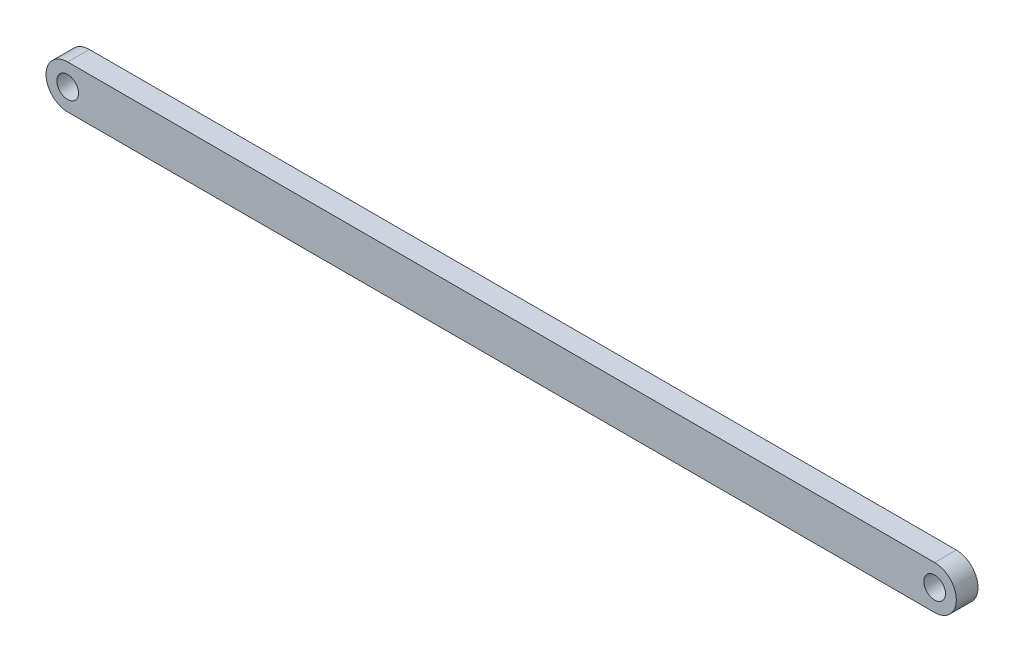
from build123d import *

# Parameters (mm, degrees)
SKETCH1_R           = 1.5875
BOSS_EXTRUDE1_DEPTH = 3.175


with BuildPart() as part:
    # Sketch1 → Boss-Extrude1 (new body)
    with BuildSketch(Plane.XY):
        with BuildLine():
            Line((0, 3.175), (127, 3.175))
            ThreePointArc((127, 3.175), (130.175, 0), (127, -3.175))
            Line((127, -3.175), (0, -3.175))
            ThreePointArc((0, -3.175), (-3.175, 0), (0, 3.175))
        make_face()
        Circle(SKETCH1_R, mode=Mode.SUBTRACT)
        with Locations((127, 0)):
            Circle(SKETCH1_R, mode=Mode.SUBTRACT)
    extrude(amount=BOSS_EXTRUDE1_DEPTH)


solid = part.part
